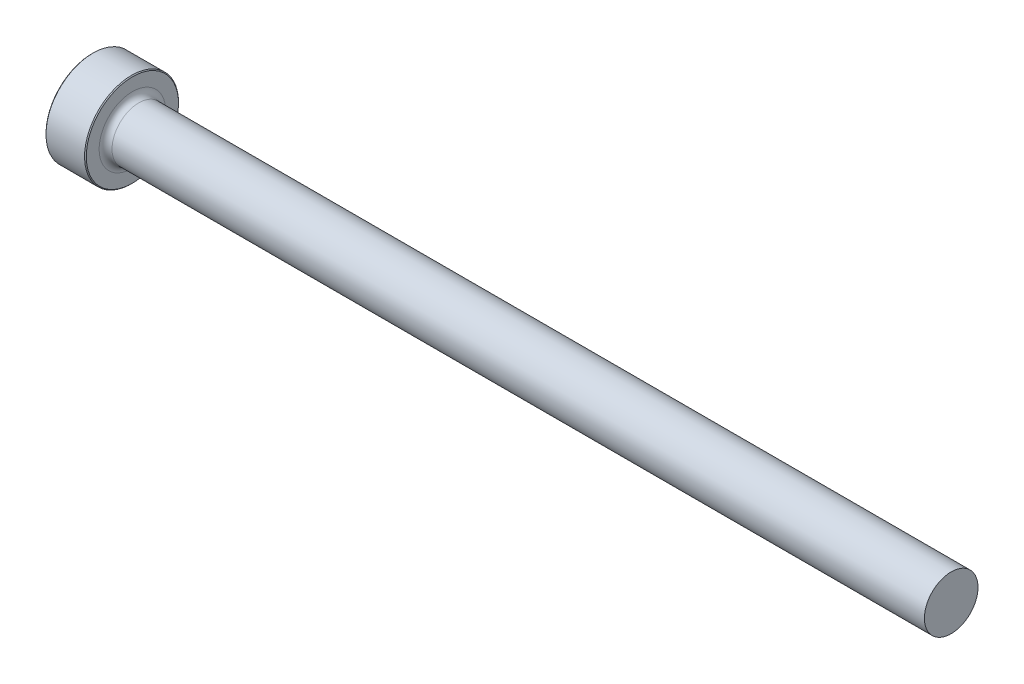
ISO-10303-21;
HEADER;
FILE_DESCRIPTION(('STEP AP214'),'2;1');
FILE_NAME('part.step','',(''),(''),'','','');
FILE_SCHEMA(('AUTOMOTIVE_DESIGN { 1 0 10303 214 1 1 1 1 }'));
ENDSEC;
DATA;
#1=APPLICATION_CONTEXT('core data for automotive mechanical design processes');
#2=APPLICATION_PROTOCOL_DEFINITION('international standard','automotive_design',2000,#1);
#3=PRODUCT_CONTEXT('',#1,'mechanical');
#4=PRODUCT('Part','Part','',(#3));
#5=PRODUCT_RELATED_PRODUCT_CATEGORY('part','',(#4));
#6=PRODUCT_DEFINITION_FORMATION('','',#4);
#7=PRODUCT_DEFINITION_CONTEXT('part definition',#1,'design');
#8=PRODUCT_DEFINITION('design','',#6,#7);
#9=PRODUCT_DEFINITION_SHAPE('','',#8);
#10=(LENGTH_UNIT() NAMED_UNIT(*) SI_UNIT(.MILLI.,.METRE.));
#11=(NAMED_UNIT(*) PLANE_ANGLE_UNIT() SI_UNIT($,.RADIAN.));
#12=(NAMED_UNIT(*) SI_UNIT($,.STERADIAN.) SOLID_ANGLE_UNIT());
#13=UNCERTAINTY_MEASURE_WITH_UNIT(LENGTH_MEASURE(1.E-05),#10,'distance_accuracy_value','');
#14=(GEOMETRIC_REPRESENTATION_CONTEXT(3) GLOBAL_UNCERTAINTY_ASSIGNED_CONTEXT((#13)) GLOBAL_UNIT_ASSIGNED_CONTEXT((#10,
#11,#12)) REPRESENTATION_CONTEXT('',''));
#15=CARTESIAN_POINT('',(0.,0.,0.));
#16=DIRECTION('',(0.,0.,1.));
#17=DIRECTION('',(1.,0.,0.));
#18=AXIS2_PLACEMENT_3D('',#15,#16,#17);
#19=CARTESIAN_POINT('',(101.6,3.17118999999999,0.));
#20=DIRECTION('',(1.,0.,0.));
#21=DIRECTION('',(0.,1.,0.));
#22=AXIS2_PLACEMENT_3D('',#19,#20,#21);
#23=PLANE('',#22);
#24=CARTESIAN_POINT('',(101.6,0.,0.));
#25=DIRECTION('',(1.,0.,0.));
#26=DIRECTION('',(0.,1.,0.));
#27=AXIS2_PLACEMENT_3D('',#24,#25,#26);
#28=CIRCLE('',#27,3.17119);
#29=CARTESIAN_POINT('',(101.6,3.17118999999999,0.));
#30=VERTEX_POINT('',#29);
#31=EDGE_CURVE('E50',#30,#30,#28,.T.);
#32=ORIENTED_EDGE('',*,*,#31,.T.);
#33=EDGE_LOOP('',(#32));
#34=FACE_BOUND('',#33,.T.);
#35=ADVANCED_FACE('F30',(#34),#23,.T.);
#36=CARTESIAN_POINT('',(101.6,0.,0.));
#37=DIRECTION('',(1.,0.,0.));
#38=DIRECTION('',(0.,1.,0.));
#39=AXIS2_PLACEMENT_3D('',#36,#37,#38);
#40=CYLINDRICAL_SURFACE('',#39,3.17119);
#41=CARTESIAN_POINT('',(5.5245,0.,0.));
#42=DIRECTION('',(1.,0.,0.));
#43=DIRECTION('',(0.,1.,0.));
#44=AXIS2_PLACEMENT_3D('',#41,#42,#43);
#45=CIRCLE('',#44,3.17118999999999);
#46=CARTESIAN_POINT('',(5.5245,3.17118999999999,0.));
#47=VERTEX_POINT('',#46);
#48=EDGE_CURVE('E53',#47,#47,#45,.T.);
#49=ORIENTED_EDGE('',*,*,#48,.T.);
#50=EDGE_LOOP('',(#49));
#51=FACE_BOUND('',#50,.T.);
#52=ORIENTED_EDGE('',*,*,#31,.F.);
#53=EDGE_LOOP('',(#52));
#54=FACE_BOUND('',#53,.T.);
#55=ADVANCED_FACE('F74',(#51,#54),#40,.T.);
#56=CARTESIAN_POINT('',(5.5245,0.,0.));
#57=DIRECTION('',(1.,0.,0.));
#58=DIRECTION('',(0.,1.,0.));
#59=AXIS2_PLACEMENT_3D('',#56,#57,#58);
#60=TOROIDAL_SURFACE('',#59,3.93318999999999,0.762);
#61=CARTESIAN_POINT('',(4.7625,0.,0.));
#62=DIRECTION('',(1.,0.,0.));
#63=DIRECTION('',(0.,1.,0.));
#64=AXIS2_PLACEMENT_3D('',#61,#62,#63);
#65=CIRCLE('',#64,3.93318999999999);
#66=CARTESIAN_POINT('',(4.7625,3.93318999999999,0.));
#67=VERTEX_POINT('',#66);
#68=EDGE_CURVE('E56',#67,#67,#65,.T.);
#69=ORIENTED_EDGE('',*,*,#68,.T.);
#70=EDGE_LOOP('',(#69));
#71=FACE_BOUND('',#70,.T.);
#72=ORIENTED_EDGE('',*,*,#48,.F.);
#73=EDGE_LOOP('',(#72));
#74=FACE_BOUND('',#73,.T.);
#75=ADVANCED_FACE('F60',(#71,#74),#60,.F.);
#76=CARTESIAN_POINT('',(4.7625,5.55625,0.));
#77=DIRECTION('',(1.,0.,0.));
#78=DIRECTION('',(0.,1.,0.));
#79=AXIS2_PLACEMENT_3D('',#76,#77,#78);
#80=PLANE('',#79);
#81=CARTESIAN_POINT('',(4.7625,0.,0.));
#82=DIRECTION('',(1.,0.,0.));
#83=DIRECTION('',(0.,1.,0.));
#84=AXIS2_PLACEMENT_3D('',#81,#82,#83);
#85=CIRCLE('',#84,5.45465000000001);
#86=CARTESIAN_POINT('',(4.7625,5.45465000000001,0.));
#87=VERTEX_POINT('',#86);
#88=EDGE_CURVE('E10',#87,#87,#85,.T.);
#89=ORIENTED_EDGE('',*,*,#88,.T.);
#90=EDGE_LOOP('',(#89));
#91=FACE_BOUND('',#90,.T.);
#92=ORIENTED_EDGE('',*,*,#68,.F.);
#93=EDGE_LOOP('',(#92));
#94=FACE_BOUND('',#93,.T.);
#95=ADVANCED_FACE('F63',(#91,#94),#80,.T.);
#96=CARTESIAN_POINT('',(101.6,0.,0.));
#97=DIRECTION('',(1.,0.,0.));
#98=DIRECTION('',(0.,1.,0.));
#99=AXIS2_PLACEMENT_3D('',#96,#97,#98);
#100=CYLINDRICAL_SURFACE('',#99,5.55625);
#101=CARTESIAN_POINT('',(0.101599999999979,0.,0.));
#102=DIRECTION('',(-1.,0.,0.));
#103=DIRECTION('',(0.,-1.,0.));
#104=AXIS2_PLACEMENT_3D('',#101,#102,#103);
#105=CIRCLE('',#104,5.55625);
#106=CARTESIAN_POINT('',(0.101599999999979,-5.55625,0.));
#107=VERTEX_POINT('',#106);
#108=EDGE_CURVE('E41',#107,#107,#105,.F.);
#109=ORIENTED_EDGE('',*,*,#108,.T.);
#110=EDGE_LOOP('',(#109));
#111=FACE_BOUND('',#110,.T.);
#112=CARTESIAN_POINT('',(4.66090000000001,0.,0.));
#113=DIRECTION('',(1.,0.,0.));
#114=DIRECTION('',(0.,1.,0.));
#115=AXIS2_PLACEMENT_3D('',#112,#113,#114);
#116=CIRCLE('',#115,5.55625);
#117=CARTESIAN_POINT('',(4.66090000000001,5.55625,0.));
#118=VERTEX_POINT('',#117);
#119=EDGE_CURVE('E45',#118,#118,#116,.F.);
#120=ORIENTED_EDGE('',*,*,#119,.T.);
#121=EDGE_LOOP('',(#120));
#122=FACE_BOUND('',#121,.T.);
#123=ADVANCED_FACE('F65',(#111,#122),#100,.T.);
#124=CARTESIAN_POINT('',(0.,0.,0.));
#125=DIRECTION('',(-1.,0.,0.));
#126=DIRECTION('',(0.,-1.,0.));
#127=AXIS2_PLACEMENT_3D('',#124,#125,#126);
#128=PLANE('',#127);
#129=CARTESIAN_POINT('',(0.,0.,0.));
#130=DIRECTION('',(-1.,0.,0.));
#131=DIRECTION('',(0.,-1.,0.));
#132=AXIS2_PLACEMENT_3D('',#129,#130,#131);
#133=CIRCLE('',#132,5.45465000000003);
#134=CARTESIAN_POINT('',(0.,-5.45465000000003,0.));
#135=VERTEX_POINT('',#134);
#136=EDGE_CURVE('E37',#135,#135,#133,.T.);
#137=ORIENTED_EDGE('',*,*,#136,.T.);
#138=EDGE_LOOP('',(#137));
#139=FACE_BOUND('',#138,.T.);
#140=ADVANCED_FACE('F71',(#139),#128,.T.);
#141=CARTESIAN_POINT('',(0.101599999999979,0.,0.));
#142=DIRECTION('',(1.,0.,0.));
#143=DIRECTION('',(0.,1.,0.));
#144=AXIS2_PLACEMENT_3D('',#141,#142,#143);
#145=CONICAL_SURFACE('',#144,5.55625,0.785398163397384);
#146=ORIENTED_EDGE('',*,*,#136,.F.);
#147=EDGE_LOOP('',(#146));
#148=FACE_BOUND('',#147,.T.);
#149=ORIENTED_EDGE('',*,*,#108,.F.);
#150=EDGE_LOOP('',(#149));
#151=FACE_BOUND('',#150,.T.);
#152=ADVANCED_FACE('F84',(#148,#151),#145,.T.);
#153=CARTESIAN_POINT('',(4.7625,0.,0.));
#154=DIRECTION('',(-1.,0.,0.));
#155=DIRECTION('',(0.,-1.,0.));
#156=AXIS2_PLACEMENT_3D('',#153,#154,#155);
#157=CONICAL_SURFACE('',#156,5.45465000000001,0.785398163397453);
#158=ORIENTED_EDGE('',*,*,#119,.F.);
#159=EDGE_LOOP('',(#158));
#160=FACE_BOUND('',#159,.T.);
#161=ORIENTED_EDGE('',*,*,#88,.F.);
#162=EDGE_LOOP('',(#161));
#163=FACE_BOUND('',#162,.T.);
#164=ADVANCED_FACE('F32',(#160,#163),#157,.T.);
#165=CLOSED_SHELL('',(#35,#55,#75,#95,#123,#140,#152,#164));
#166=MANIFOLD_SOLID_BREP('B2',#165);
#167=ADVANCED_BREP_SHAPE_REPRESENTATION('',(#18,#166),#14);
#168=SHAPE_DEFINITION_REPRESENTATION(#9,#167);
ENDSEC;
END-ISO-10303-21;
